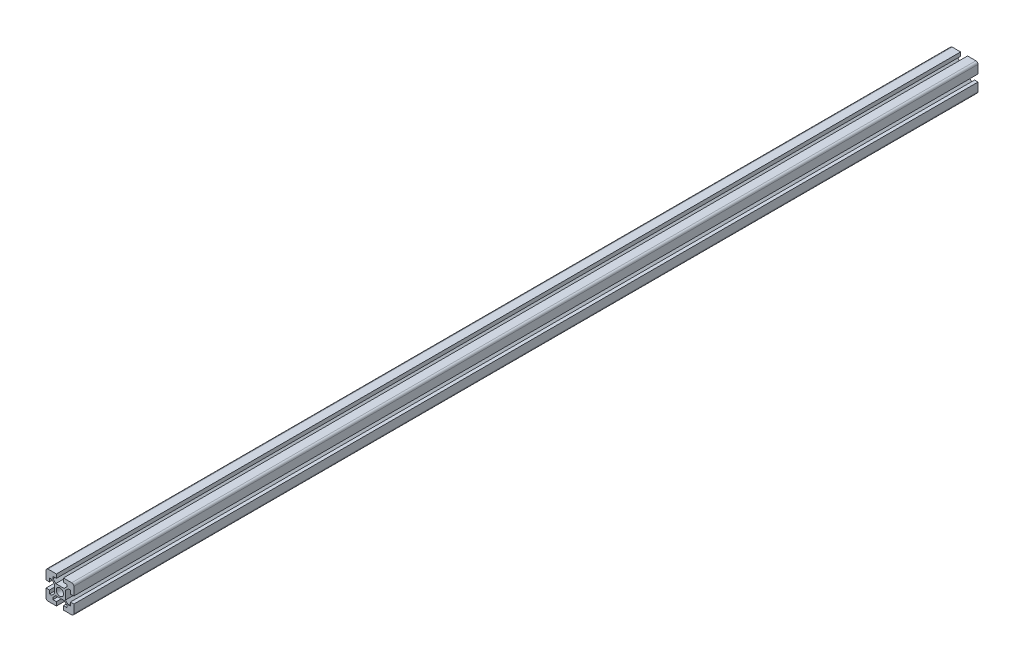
from build123d import *

# Parameters (mm, degrees)
SKETCH_1_R      = 5.25
EXTRUDE_1_DEPTH = 1300


with BuildPart() as part:
    # Sketch 1 → Extrude 1 (new body)
    with BuildSketch(Plane.XY):
        with BuildLine():
            Line((10, -5.5), (15, -5.5))
            Line((15, -5.5), (15, 0))
            Line((15, 0), (3, 0))
            ThreePointArc((3, 0), (0.878679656, -0.878679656), (0, -3))
            Line((0, -3), (0, -15))
            Line((0, -15), (5, -15))
            Line((5, -15), (5, -10))
            Line((5, -10), (8, -10))
            Line((8, -10), (12, -14))
            Line((12, -14), (12, -26))
            Line((12, -26), (8, -30))
            Line((8, -30), (5, -30))
            Line((5, -30), (5, -25))
            Line((5, -25), (0, -25))
            Line((0, -25), (0, -37))
            ThreePointArc((0, -37), (0.878679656, -39.121320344), (3, -40))
            Line((3, -40), (15, -40))
            Line((15, -40), (15, -34.5))
            Line((15, -34.5), (10, -34.5))
            Line((10, -34.5), (10, -31.5))
            Line((10, -31.5), (14, -27.5))
            Line((14, -27.5), (26, -27.5))
            Line((26, -27.5), (30, -31.5))
            Line((30, -31.5), (30, -34.5))
            Line((30, -34.5), (25, -34.5))
            Line((25, -34.5), (25, -40))
            Line((25, -40), (37, -40))
            ThreePointArc((37, -40), (39.121320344, -39.121320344), (40, -37))
            Line((40, -37), (40, -25))
            Line((40, -25), (35, -25))
            Line((35, -25), (35, -30))
            Line((35, -30), (32, -30))
            Line((32, -30), (28, -26))
            Line((28, -26), (28, -14))
            Line((28, -14), (32, -10))
            Line((32, -10), (35, -10))
            Line((35, -10), (35, -15))
            Line((35, -15), (40, -15))
            Line((40, -15), (40, -3))
            ThreePointArc((40, -3), (39.121320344, -0.878679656), (37, 0))
            Line((37, 0), (25, 0))
            Line((25, 0), (25, -5.5))
            Line((25, -5.5), (30, -5.5))
            Line((30, -5.5), (30, -8.5))
            Line((30, -8.5), (26, -12.5))
            Line((26, -12.5), (14, -12.5))
            Line((14, -12.5), (10, -8.5))
            Line((10, -8.5), (10, -5.5))
        make_face()
        with Locations((20, -20)):
            Circle(SKETCH_1_R, mode=Mode.SUBTRACT)
    extrude(amount=EXTRUDE_1_DEPTH)


solid = part.part
